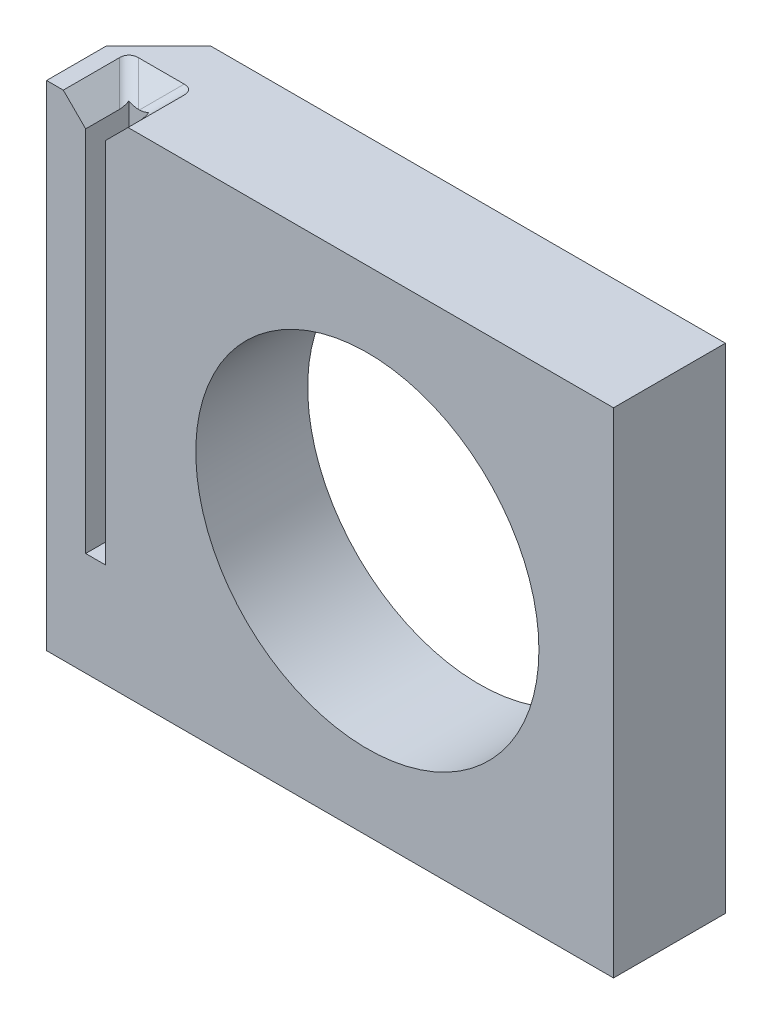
from build123d import *

# Parameters (mm, degrees)
SKETCH1_W          = 48.26
SKETCH1_H          = 42.037
BASE_EXTRUDE_DEPTH = 9.525
SKETCH2_R          = 14.605
CUT_EXTRUDE1_DEPTH = 34.388019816
SKETCH3_W          = 1.7018
SKETCH3_H          = 33.2105
CUT_EXTRUDE2_DEPTH = 3.683
CHAMFER1_SIZE      = 4.445
CHAMFER2_SIZE      = 1.905
FILLET2_R          = 1.143


with BuildPart() as part:
    # Sketch1 → Base-Extrude (new body)
    with BuildSketch(Plane.XY):
        Rectangle(SKETCH1_W, SKETCH1_H)
    extrude(amount=-BASE_EXTRUDE_DEPTH)

    # Sketch2 → Cut-Extrude1 (cut, through all)
    with BuildSketch(Plane.XY):
        with Locations((3.175, 0)):
            Circle(SKETCH2_R)
    extrude(amount=-CUT_EXTRUDE1_DEPTH, mode=Mode.SUBTRACT)

    # Sketch3 → Cut-Extrude2 (cut)
    with BuildSketch(Plane.XY):
        with Locations((-19.9517, 4.41325)):
            Rectangle(SKETCH3_W, SKETCH3_H)
    extrude(amount=-CUT_EXTRUDE2_DEPTH, mode=Mode.SUBTRACT)

    # Chamfer1
    chamfer1_edges = [part.edges().sort_by_distance(p)[0] for p in [
        (-24.13, 0, -9.525),
    ]]
    chamfer(chamfer1_edges, length=CHAMFER1_SIZE)

    # Chamfer2
    chamfer2_edges = [part.edges().sort_by_distance(p)[0] for p in [
        (-19.1008, 21.0185, -1.8415),
        (-20.8026, 21.0185, -1.8415),
        (-19.9517, 21.0185, -3.683),
    ]]
    chamfer(chamfer2_edges, length=CHAMFER2_SIZE)

    # Fillet2
    fillet2_edges = [part.edges().sort_by_distance(p)[0] for p in [
        (-18.1483, 20.066, -4.6355),
        (-21.7551, 20.066, -4.6355),
    ]]
    fillet(fillet2_edges, radius=FILLET2_R)


solid = part.part
